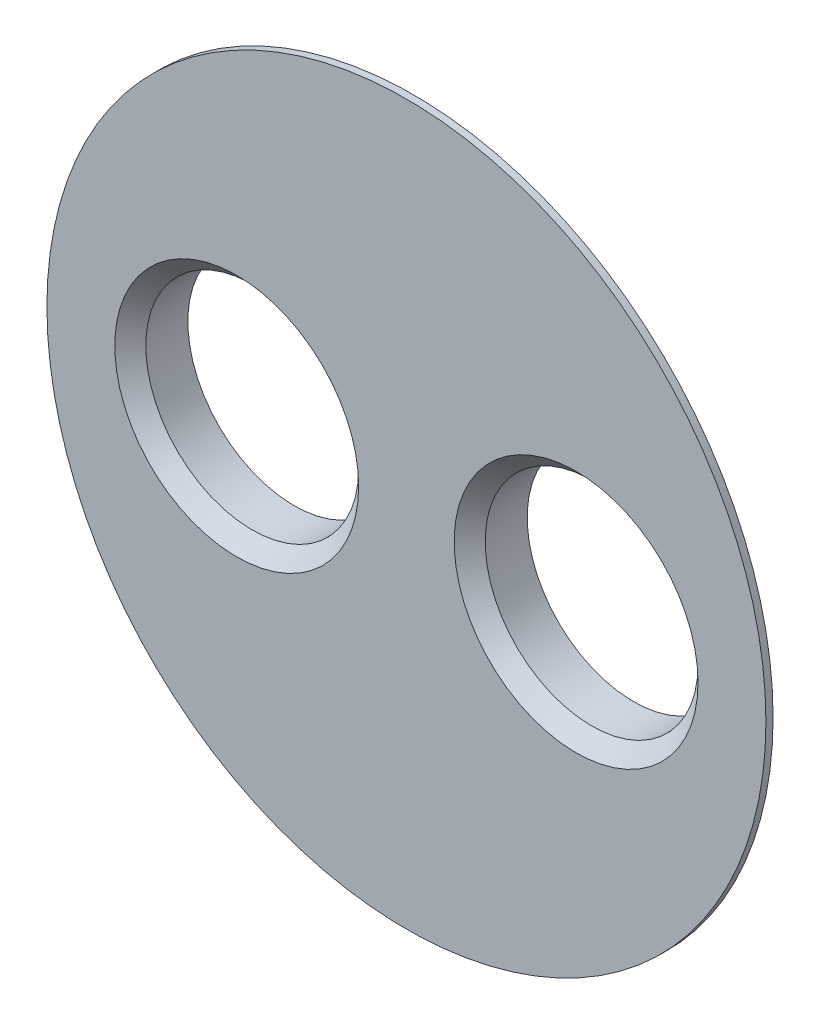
from build123d import *

# Parameters (mm, degrees)
ESQUISSE1_R             = 62.5
BOSS_EXTRU_1_DEPTH      = 10
ESQUISSE2_R             = 18.5
ENL_V_MAT_EXTRU_1_DEPTH = 10
CHANFREIN1_SIZE         = 2.7
CHANFREIN2_SIZE         = 12.5
CHANFREIN2_SIZE2        = 8.752594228


with BuildPart() as part:
    # Esquisse1 → Boss.-Extru.1 (new body)
    with BuildSketch(Plane.XY):
        Circle(ESQUISSE1_R)
    extrude(amount=BOSS_EXTRU_1_DEPTH)

    # Esquisse2 → Enl_v. mat.-Extru.1 (cut)
    with BuildSketch(Plane.XY.offset(10)):
        with Locations((-29.5, 0)):
            Circle(ESQUISSE2_R)
        with Locations((29.5, 0)):
            Circle(ESQUISSE2_R)
    extrude(amount=-ENL_V_MAT_EXTRU_1_DEPTH, mode=Mode.SUBTRACT)

    # Chanfrein1
    chanfrein1_edges = [part.edges().sort_by_distance(p)[0] for p in [
        (11, 0, 10),
        (-48, 0, 10),
    ]]
    chamfer(chanfrein1_edges, length=CHANFREIN1_SIZE)

    # Chanfrein2
    chanfrein2_edges = [part.edges().sort_by_distance(p)[0] for p in [
        (-62.5, 0, 0),
    ]]
    chanfrein2_side = [part.faces().sort_by_distance(p)[0] for p in [
        (0, 0, 0),
    ]]
    chamfer(chanfrein2_edges, length=CHANFREIN2_SIZE, length2=CHANFREIN2_SIZE2, reference=chanfrein2_side[0])


solid = part.part
